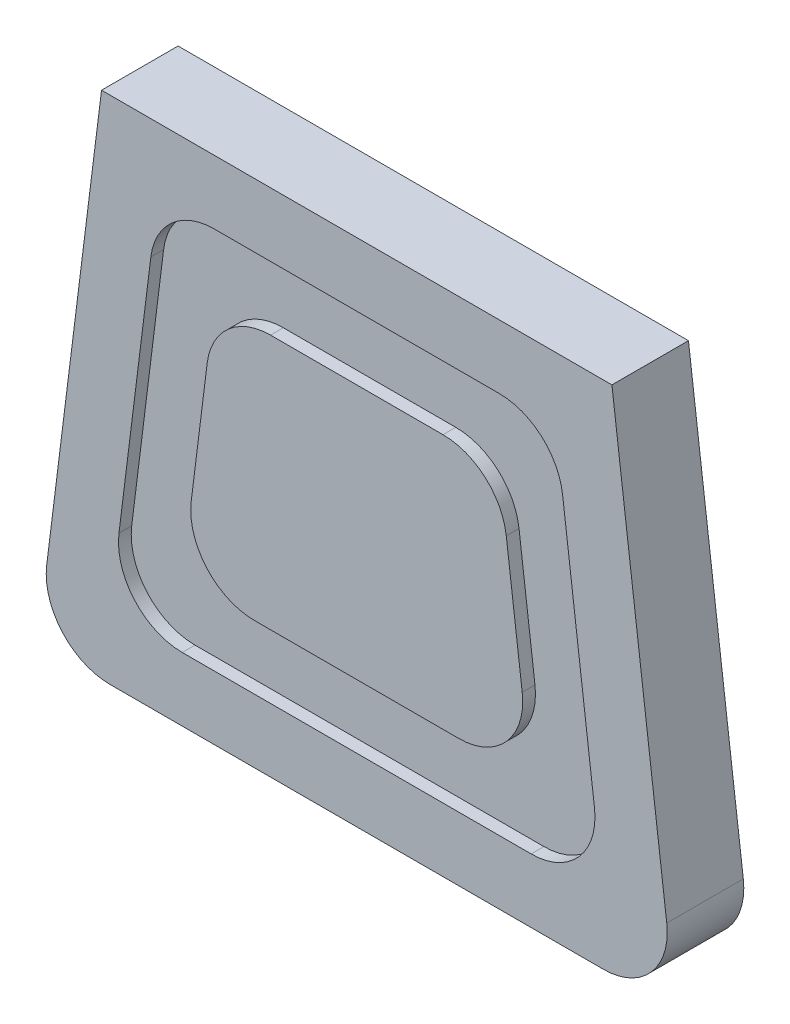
ISO-10303-21;
HEADER;
FILE_DESCRIPTION(('STEP AP214'),'2;1');
FILE_NAME('part.step','',(''),(''),'','','');
FILE_SCHEMA(('AUTOMOTIVE_DESIGN { 1 0 10303 214 1 1 1 1 }'));
ENDSEC;
DATA;
#1=APPLICATION_CONTEXT('core data for automotive mechanical design processes');
#2=APPLICATION_PROTOCOL_DEFINITION('international standard','automotive_design',2000,#1);
#3=PRODUCT_CONTEXT('',#1,'mechanical');
#4=PRODUCT('Part','Part','',(#3));
#5=PRODUCT_RELATED_PRODUCT_CATEGORY('part','',(#4));
#6=PRODUCT_DEFINITION_FORMATION('','',#4);
#7=PRODUCT_DEFINITION_CONTEXT('part definition',#1,'design');
#8=PRODUCT_DEFINITION('design','',#6,#7);
#9=PRODUCT_DEFINITION_SHAPE('','',#8);
#10=(LENGTH_UNIT() NAMED_UNIT(*) SI_UNIT(.MILLI.,.METRE.));
#11=(NAMED_UNIT(*) PLANE_ANGLE_UNIT() SI_UNIT($,.RADIAN.));
#12=(NAMED_UNIT(*) SI_UNIT($,.STERADIAN.) SOLID_ANGLE_UNIT());
#13=UNCERTAINTY_MEASURE_WITH_UNIT(LENGTH_MEASURE(1.E-05),#10,'distance_accuracy_value','');
#14=(GEOMETRIC_REPRESENTATION_CONTEXT(3) GLOBAL_UNCERTAINTY_ASSIGNED_CONTEXT((#13)) GLOBAL_UNIT_ASSIGNED_CONTEXT((#10,
#11,#12)) REPRESENTATION_CONTEXT('',''));
#15=CARTESIAN_POINT('',(0.,0.,0.));
#16=DIRECTION('',(0.,0.,1.));
#17=DIRECTION('',(1.,0.,0.));
#18=AXIS2_PLACEMENT_3D('',#15,#16,#17);
#19=CARTESIAN_POINT('',(-20.,0.,6.));
#20=DIRECTION('',(0.992277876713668,-0.124034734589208,0.));
#21=DIRECTION('',(0.124034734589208,0.992277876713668,0.));
#22=AXIS2_PLACEMENT_3D('',#19,#20,#21);
#23=PLANE('',#22);
#24=DIRECTION('',(-0.124034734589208,-0.992277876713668,0.));
#25=VECTOR('',#24,1.);
#26=CARTESIAN_POINT('',(-20.,0.,0.));
#27=LINE('',#26,#25);
#28=CARTESIAN_POINT('',(-20.,0.,0.));
#29=VERTEX_POINT('',#28);
#30=CARTESIAN_POINT('',(-24.2974782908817,-34.379826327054,0.));
#31=VERTEX_POINT('',#30);
#32=EDGE_CURVE('E198',#29,#31,#27,.T.);
#33=ORIENTED_EDGE('',*,*,#32,.T.);
#34=DIRECTION('',(0.,0.,-1.));
#35=VECTOR('',#34,1.);
#36=CARTESIAN_POINT('',(-24.2974782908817,-34.379826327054,6.));
#37=LINE('',#36,#35);
#38=CARTESIAN_POINT('',(-24.2974782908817,-34.379826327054,6.));
#39=VERTEX_POINT('',#38);
#40=EDGE_CURVE('E226',#31,#39,#37,.F.);
#41=ORIENTED_EDGE('',*,*,#40,.T.);
#42=DIRECTION('',(-0.124034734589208,-0.992277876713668,0.));
#43=VECTOR('',#42,1.);
#44=CARTESIAN_POINT('',(-20.,0.,6.));
#45=LINE('',#44,#43);
#46=CARTESIAN_POINT('',(-20.,0.,6.));
#47=VERTEX_POINT('',#46);
#48=EDGE_CURVE('E199',#47,#39,#45,.T.);
#49=ORIENTED_EDGE('',*,*,#48,.F.);
#50=DIRECTION('',(0.,0.,-1.));
#51=VECTOR('',#50,1.);
#52=CARTESIAN_POINT('',(-20.,0.,6.));
#53=LINE('',#52,#51);
#54=EDGE_CURVE('E193',#47,#29,#53,.T.);
#55=ORIENTED_EDGE('',*,*,#54,.T.);
#56=EDGE_LOOP('',(#33,#41,#49,#55));
#57=FACE_BOUND('',#56,.T.);
#58=ADVANCED_FACE('F26',(#57),#23,.F.);
#59=CARTESIAN_POINT('',(-25.,-40.,6.));
#60=DIRECTION('',(0.,1.,0.));
#61=DIRECTION('',(0.,0.,1.));
#62=AXIS2_PLACEMENT_3D('',#59,#60,#61);
#63=PLANE('',#62);
#64=DIRECTION('',(1.,0.,0.));
#65=VECTOR('',#64,1.);
#66=CARTESIAN_POINT('',(-25.,-40.,0.));
#67=LINE('',#66,#65);
#68=CARTESIAN_POINT('',(-19.3360889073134,-40.,0.));
#69=VERTEX_POINT('',#68);
#70=CARTESIAN_POINT('',(19.3360889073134,-40.,0.));
#71=VERTEX_POINT('',#70);
#72=EDGE_CURVE('E186',#69,#71,#67,.T.);
#73=ORIENTED_EDGE('',*,*,#72,.T.);
#74=DIRECTION('',(0.,0.,-1.));
#75=VECTOR('',#74,1.);
#76=CARTESIAN_POINT('',(19.3360889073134,-40.,6.));
#77=LINE('',#76,#75);
#78=CARTESIAN_POINT('',(19.3360889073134,-40.,6.));
#79=VERTEX_POINT('',#78);
#80=EDGE_CURVE('E220',#71,#79,#77,.F.);
#81=ORIENTED_EDGE('',*,*,#80,.T.);
#82=DIRECTION('',(1.,0.,0.));
#83=VECTOR('',#82,1.);
#84=CARTESIAN_POINT('',(-25.,-40.,6.));
#85=LINE('',#84,#83);
#86=CARTESIAN_POINT('',(-19.3360889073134,-40.,6.));
#87=VERTEX_POINT('',#86);
#88=EDGE_CURVE('E202',#87,#79,#85,.T.);
#89=ORIENTED_EDGE('',*,*,#88,.F.);
#90=DIRECTION('',(0.,0.,-1.));
#91=VECTOR('',#90,1.);
#92=CARTESIAN_POINT('',(-19.3360889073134,-40.,6.));
#93=LINE('',#92,#91);
#94=EDGE_CURVE('E217',#87,#69,#93,.T.);
#95=ORIENTED_EDGE('',*,*,#94,.T.);
#96=EDGE_LOOP('',(#73,#81,#89,#95));
#97=FACE_BOUND('',#96,.T.);
#98=ADVANCED_FACE('F366',(#97),#63,.F.);
#99=CARTESIAN_POINT('',(20.,0.,6.));
#100=DIRECTION('',(-0.992277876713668,-0.124034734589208,0.));
#101=DIRECTION('',(0.124034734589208,-0.992277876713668,0.));
#102=AXIS2_PLACEMENT_3D('',#99,#100,#101);
#103=PLANE('',#102);
#104=DIRECTION('',(-0.124034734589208,0.992277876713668,0.));
#105=VECTOR('',#104,1.);
#106=CARTESIAN_POINT('',(20.,0.,6.));
#107=LINE('',#106,#105);
#108=CARTESIAN_POINT('',(24.2974782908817,-34.379826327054,6.));
#109=VERTEX_POINT('',#108);
#110=CARTESIAN_POINT('',(20.,0.,6.));
#111=VERTEX_POINT('',#110);
#112=EDGE_CURVE('E208',#109,#111,#107,.T.);
#113=ORIENTED_EDGE('',*,*,#112,.F.);
#114=DIRECTION('',(0.,0.,-1.));
#115=VECTOR('',#114,1.);
#116=CARTESIAN_POINT('',(24.2974782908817,-34.379826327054,6.));
#117=LINE('',#116,#115);
#118=CARTESIAN_POINT('',(24.2974782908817,-34.379826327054,0.));
#119=VERTEX_POINT('',#118);
#120=EDGE_CURVE('E182',#109,#119,#117,.T.);
#121=ORIENTED_EDGE('',*,*,#120,.T.);
#122=DIRECTION('',(-0.124034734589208,0.992277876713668,0.));
#123=VECTOR('',#122,1.);
#124=CARTESIAN_POINT('',(20.,0.,0.));
#125=LINE('',#124,#123);
#126=CARTESIAN_POINT('',(20.,0.,0.));
#127=VERTEX_POINT('',#126);
#128=EDGE_CURVE('E175',#119,#127,#125,.T.);
#129=ORIENTED_EDGE('',*,*,#128,.T.);
#130=DIRECTION('',(0.,0.,-1.));
#131=VECTOR('',#130,1.);
#132=CARTESIAN_POINT('',(20.,0.,6.));
#133=LINE('',#132,#131);
#134=EDGE_CURVE('E179',#111,#127,#133,.T.);
#135=ORIENTED_EDGE('',*,*,#134,.F.);
#136=EDGE_LOOP('',(#113,#121,#129,#135));
#137=FACE_BOUND('',#136,.T.);
#138=ADVANCED_FACE('F178',(#137),#103,.F.);
#139=CARTESIAN_POINT('',(20.,0.,6.));
#140=DIRECTION('',(0.,-1.,0.));
#141=DIRECTION('',(0.,0.,-1.));
#142=AXIS2_PLACEMENT_3D('',#139,#140,#141);
#143=PLANE('',#142);
#144=DIRECTION('',(-1.,0.,0.));
#145=VECTOR('',#144,1.);
#146=CARTESIAN_POINT('',(20.,0.,0.));
#147=LINE('',#146,#145);
#148=EDGE_CURVE('E185',#127,#29,#147,.T.);
#149=ORIENTED_EDGE('',*,*,#148,.T.);
#150=ORIENTED_EDGE('',*,*,#54,.F.);
#151=DIRECTION('',(-1.,0.,0.));
#152=VECTOR('',#151,1.);
#153=CARTESIAN_POINT('',(20.,0.,6.));
#154=LINE('',#153,#152);
#155=EDGE_CURVE('E192',#111,#47,#154,.T.);
#156=ORIENTED_EDGE('',*,*,#155,.F.);
#157=ORIENTED_EDGE('',*,*,#134,.T.);
#158=EDGE_LOOP('',(#149,#150,#156,#157));
#159=FACE_BOUND('',#158,.T.);
#160=ADVANCED_FACE('F189',(#159),#143,.F.);
#161=CARTESIAN_POINT('',(-25.,-40.,6.));
#162=DIRECTION('',(0.,0.,1.));
#163=DIRECTION('',(1.,0.,0.));
#164=AXIS2_PLACEMENT_3D('',#161,#162,#163);
#165=PLANE('',#164);
#166=DIRECTION('',(-0.124034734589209,-0.992277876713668,0.));
#167=VECTOR('',#166,1.);
#168=CARTESIAN_POINT('',(-15.5860889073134,-5.,6.));
#169=LINE('',#168,#167);
#170=CARTESIAN_POINT('',(-16.1335671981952,-9.37982632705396,6.));
#171=VERTEX_POINT('',#170);
#172=CARTESIAN_POINT('',(-18.6335671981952,-29.379826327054,6.));
#173=VERTEX_POINT('',#172);
#174=EDGE_CURVE('E339',#171,#173,#169,.T.);
#175=ORIENTED_EDGE('',*,*,#174,.F.);
#176=CARTESIAN_POINT('',(-11.1721778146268,-10.,6.));
#177=DIRECTION('',(0.,0.,1.));
#178=DIRECTION('',(1.,0.,0.));
#179=AXIS2_PLACEMENT_3D('',#176,#177,#178);
#180=CIRCLE('',#179,5.);
#181=CARTESIAN_POINT('',(-11.1721778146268,-5.,6.));
#182=VERTEX_POINT('',#181);
#183=EDGE_CURVE('E283',#171,#182,#180,.F.);
#184=ORIENTED_EDGE('',*,*,#183,.T.);
#185=DIRECTION('',(-1.,0.,0.));
#186=VECTOR('',#185,1.);
#187=CARTESIAN_POINT('',(15.5860889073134,-4.99999999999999,6.));
#188=LINE('',#187,#186);
#189=CARTESIAN_POINT('',(11.1721778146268,-5.,6.));
#190=VERTEX_POINT('',#189);
#191=EDGE_CURVE('E347',#190,#182,#188,.T.);
#192=ORIENTED_EDGE('',*,*,#191,.F.);
#193=CARTESIAN_POINT('',(11.1721778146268,-10.,6.));
#194=DIRECTION('',(0.,0.,1.));
#195=DIRECTION('',(1.,0.,0.));
#196=AXIS2_PLACEMENT_3D('',#193,#194,#195);
#197=CIRCLE('',#196,5.);
#198=CARTESIAN_POINT('',(16.1335671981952,-9.37982632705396,6.));
#199=VERTEX_POINT('',#198);
#200=EDGE_CURVE('E285',#190,#199,#197,.F.);
#201=ORIENTED_EDGE('',*,*,#200,.T.);
#202=DIRECTION('',(-0.124034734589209,0.992277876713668,0.));
#203=VECTOR('',#202,1.);
#204=CARTESIAN_POINT('',(15.5860889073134,-4.99999999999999,6.));
#205=LINE('',#204,#203);
#206=CARTESIAN_POINT('',(18.6335671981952,-29.3798263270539,6.));
#207=VERTEX_POINT('',#206);
#208=EDGE_CURVE('E344',#207,#199,#205,.T.);
#209=ORIENTED_EDGE('',*,*,#208,.F.);
#210=CARTESIAN_POINT('',(13.6721778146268,-30.,6.));
#211=DIRECTION('',(0.,0.,1.));
#212=DIRECTION('',(1.,0.,0.));
#213=AXIS2_PLACEMENT_3D('',#210,#211,#212);
#214=CIRCLE('',#213,5.);
#215=CARTESIAN_POINT('',(13.6721778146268,-35.,6.));
#216=VERTEX_POINT('',#215);
#217=EDGE_CURVE('E40',#207,#216,#214,.F.);
#218=ORIENTED_EDGE('',*,*,#217,.T.);
#219=DIRECTION('',(1.,0.,0.));
#220=VECTOR('',#219,1.);
#221=CARTESIAN_POINT('',(-19.3360889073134,-35.,6.));
#222=LINE('',#221,#220);
#223=CARTESIAN_POINT('',(-13.6721778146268,-35.,6.));
#224=VERTEX_POINT('',#223);
#225=EDGE_CURVE('E342',#224,#216,#222,.T.);
#226=ORIENTED_EDGE('',*,*,#225,.F.);
#227=CARTESIAN_POINT('',(-13.6721778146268,-30.,6.));
#228=DIRECTION('',(0.,0.,1.));
#229=DIRECTION('',(1.,0.,0.));
#230=AXIS2_PLACEMENT_3D('',#227,#228,#229);
#231=CIRCLE('',#230,5.);
#232=EDGE_CURVE('E11',#224,#173,#231,.F.);
#233=ORIENTED_EDGE('',*,*,#232,.T.);
#234=EDGE_LOOP('',(#175,#184,#192,#201,#209,#218,#226,#233));
#235=FACE_BOUND('',#234,.T.);
#236=ORIENTED_EDGE('',*,*,#88,.T.);
#237=CARTESIAN_POINT('',(19.3360889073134,-35.,6.));
#238=DIRECTION('',(0.,0.,1.));
#239=DIRECTION('',(1.,0.,0.));
#240=AXIS2_PLACEMENT_3D('',#237,#238,#239);
#241=CIRCLE('',#240,5.);
#242=EDGE_CURVE('E224',#79,#109,#241,.T.);
#243=ORIENTED_EDGE('',*,*,#242,.T.);
#244=ORIENTED_EDGE('',*,*,#112,.T.);
#245=ORIENTED_EDGE('',*,*,#155,.T.);
#246=ORIENTED_EDGE('',*,*,#48,.T.);
#247=CARTESIAN_POINT('',(-19.3360889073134,-35.,6.));
#248=DIRECTION('',(0.,0.,1.));
#249=DIRECTION('',(1.,0.,0.));
#250=AXIS2_PLACEMENT_3D('',#247,#248,#249);
#251=CIRCLE('',#250,5.);
#252=EDGE_CURVE('E222',#39,#87,#251,.T.);
#253=ORIENTED_EDGE('',*,*,#252,.T.);
#254=EDGE_LOOP('',(#236,#243,#244,#245,#246,#253));
#255=FACE_BOUND('',#254,.T.);
#256=ADVANCED_FACE('F373',(#235,#255),#165,.T.);
#257=CARTESIAN_POINT('',(-25.,-40.,0.));
#258=DIRECTION('',(0.,0.,1.));
#259=DIRECTION('',(1.,0.,0.));
#260=AXIS2_PLACEMENT_3D('',#257,#258,#259);
#261=PLANE('',#260);
#262=ORIENTED_EDGE('',*,*,#128,.F.);
#263=CARTESIAN_POINT('',(19.3360889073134,-35.,0.));
#264=DIRECTION('',(0.,0.,1.));
#265=DIRECTION('',(1.,0.,0.));
#266=AXIS2_PLACEMENT_3D('',#263,#264,#265);
#267=CIRCLE('',#266,5.);
#268=EDGE_CURVE('E215',#119,#71,#267,.F.);
#269=ORIENTED_EDGE('',*,*,#268,.T.);
#270=ORIENTED_EDGE('',*,*,#72,.F.);
#271=CARTESIAN_POINT('',(-19.3360889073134,-35.,0.));
#272=DIRECTION('',(0.,0.,1.));
#273=DIRECTION('',(1.,0.,0.));
#274=AXIS2_PLACEMENT_3D('',#271,#272,#273);
#275=CIRCLE('',#274,5.);
#276=EDGE_CURVE('E213',#69,#31,#275,.F.);
#277=ORIENTED_EDGE('',*,*,#276,.T.);
#278=ORIENTED_EDGE('',*,*,#32,.F.);
#279=ORIENTED_EDGE('',*,*,#148,.F.);
#280=EDGE_LOOP('',(#262,#269,#270,#277,#278,#279));
#281=FACE_BOUND('',#280,.T.);
#282=ADVANCED_FACE('F196',(#281),#261,.F.);
#283=CARTESIAN_POINT('',(19.3360889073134,-35.,6.));
#284=DIRECTION('',(0.,0.,-1.));
#285=DIRECTION('',(-1.,0.,0.));
#286=AXIS2_PLACEMENT_3D('',#283,#284,#285);
#287=CYLINDRICAL_SURFACE('',#286,5.);
#288=ORIENTED_EDGE('',*,*,#242,.F.);
#289=ORIENTED_EDGE('',*,*,#80,.F.);
#290=ORIENTED_EDGE('',*,*,#268,.F.);
#291=ORIENTED_EDGE('',*,*,#120,.F.);
#292=EDGE_LOOP('',(#288,#289,#290,#291));
#293=FACE_BOUND('',#292,.T.);
#294=ADVANCED_FACE('F371',(#293),#287,.T.);
#295=CARTESIAN_POINT('',(-19.3360889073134,-35.,6.));
#296=DIRECTION('',(0.,0.,-1.));
#297=DIRECTION('',(-1.,0.,0.));
#298=AXIS2_PLACEMENT_3D('',#295,#296,#297);
#299=CYLINDRICAL_SURFACE('',#298,5.);
#300=ORIENTED_EDGE('',*,*,#252,.F.);
#301=ORIENTED_EDGE('',*,*,#40,.F.);
#302=ORIENTED_EDGE('',*,*,#276,.F.);
#303=ORIENTED_EDGE('',*,*,#94,.F.);
#304=EDGE_LOOP('',(#300,#301,#302,#303));
#305=FACE_BOUND('',#304,.T.);
#306=ADVANCED_FACE('F376',(#305),#299,.T.);
#307=CARTESIAN_POINT('',(-15.5860889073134,-5.,5.));
#308=DIRECTION('',(-0.992277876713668,0.124034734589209,0.));
#309=DIRECTION('',(-0.124034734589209,-0.992277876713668,0.));
#310=AXIS2_PLACEMENT_3D('',#307,#308,#309);
#311=PLANE('',#310);
#312=DIRECTION('',(-0.124034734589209,-0.992277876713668,0.));
#313=VECTOR('',#312,1.);
#314=CARTESIAN_POINT('',(-15.5860889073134,-5.,5.));
#315=LINE('',#314,#313);
#316=CARTESIAN_POINT('',(-16.1335671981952,-9.37982632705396,5.));
#317=VERTEX_POINT('',#316);
#318=CARTESIAN_POINT('',(-18.6335671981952,-29.379826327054,5.));
#319=VERTEX_POINT('',#318);
#320=EDGE_CURVE('E350',#317,#319,#315,.T.);
#321=ORIENTED_EDGE('',*,*,#320,.F.);
#322=DIRECTION('',(0.,0.,1.));
#323=VECTOR('',#322,1.);
#324=CARTESIAN_POINT('',(-16.1335671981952,-9.37982632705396,6.));
#325=LINE('',#324,#323);
#326=EDGE_CURVE('E230',#317,#171,#325,.T.);
#327=ORIENTED_EDGE('',*,*,#326,.T.);
#328=ORIENTED_EDGE('',*,*,#174,.T.);
#329=DIRECTION('',(0.,0.,1.));
#330=VECTOR('',#329,1.);
#331=CARTESIAN_POINT('',(-18.6335671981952,-29.379826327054,5.));
#332=LINE('',#331,#330);
#333=EDGE_CURVE('E228',#173,#319,#332,.F.);
#334=ORIENTED_EDGE('',*,*,#333,.T.);
#335=EDGE_LOOP('',(#321,#327,#328,#334));
#336=FACE_BOUND('',#335,.T.);
#337=ADVANCED_FACE('F399',(#336),#311,.F.);
#338=CARTESIAN_POINT('',(15.5860889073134,-4.99999999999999,5.));
#339=DIRECTION('',(0.,1.,0.));
#340=DIRECTION('',(-1.,0.,0.));
#341=AXIS2_PLACEMENT_3D('',#338,#339,#340);
#342=PLANE('',#341);
#343=ORIENTED_EDGE('',*,*,#191,.T.);
#344=DIRECTION('',(0.,0.,1.));
#345=VECTOR('',#344,1.);
#346=CARTESIAN_POINT('',(-11.1721778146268,-5.,5.));
#347=LINE('',#346,#345);
#348=CARTESIAN_POINT('',(-11.1721778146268,-5.,5.));
#349=VERTEX_POINT('',#348);
#350=EDGE_CURVE('E236',#182,#349,#347,.F.);
#351=ORIENTED_EDGE('',*,*,#350,.T.);
#352=DIRECTION('',(-1.,0.,0.));
#353=VECTOR('',#352,1.);
#354=CARTESIAN_POINT('',(15.5860889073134,-4.99999999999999,5.));
#355=LINE('',#354,#353);
#356=CARTESIAN_POINT('',(11.1721778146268,-5.,5.));
#357=VERTEX_POINT('',#356);
#358=EDGE_CURVE('E359',#357,#349,#355,.T.);
#359=ORIENTED_EDGE('',*,*,#358,.F.);
#360=DIRECTION('',(0.,0.,1.));
#361=VECTOR('',#360,1.);
#362=CARTESIAN_POINT('',(11.1721778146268,-5.,6.));
#363=LINE('',#362,#361);
#364=EDGE_CURVE('E233',#357,#190,#363,.T.);
#365=ORIENTED_EDGE('',*,*,#364,.T.);
#366=EDGE_LOOP('',(#343,#351,#359,#365));
#367=FACE_BOUND('',#366,.T.);
#368=ADVANCED_FACE('F402',(#367),#342,.F.);
#369=CARTESIAN_POINT('',(15.5860889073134,-4.99999999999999,5.));
#370=DIRECTION('',(0.992277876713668,0.124034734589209,0.));
#371=DIRECTION('',(-0.124034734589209,0.992277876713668,0.));
#372=AXIS2_PLACEMENT_3D('',#369,#370,#371);
#373=PLANE('',#372);
#374=ORIENTED_EDGE('',*,*,#208,.T.);
#375=DIRECTION('',(0.,0.,1.));
#376=VECTOR('',#375,1.);
#377=CARTESIAN_POINT('',(16.1335671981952,-9.37982632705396,5.));
#378=LINE('',#377,#376);
#379=CARTESIAN_POINT('',(16.1335671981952,-9.37982632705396,5.));
#380=VERTEX_POINT('',#379);
#381=EDGE_CURVE('E249',#199,#380,#378,.F.);
#382=ORIENTED_EDGE('',*,*,#381,.T.);
#383=DIRECTION('',(-0.124034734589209,0.992277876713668,0.));
#384=VECTOR('',#383,1.);
#385=CARTESIAN_POINT('',(15.5860889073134,-4.99999999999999,5.));
#386=LINE('',#385,#384);
#387=CARTESIAN_POINT('',(18.6335671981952,-29.3798263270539,5.));
#388=VERTEX_POINT('',#387);
#389=EDGE_CURVE('E356',#388,#380,#386,.T.);
#390=ORIENTED_EDGE('',*,*,#389,.F.);
#391=DIRECTION('',(0.,0.,1.));
#392=VECTOR('',#391,1.);
#393=CARTESIAN_POINT('',(18.6335671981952,-29.3798263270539,6.));
#394=LINE('',#393,#392);
#395=EDGE_CURVE('E246',#388,#207,#394,.T.);
#396=ORIENTED_EDGE('',*,*,#395,.T.);
#397=EDGE_LOOP('',(#374,#382,#390,#396));
#398=FACE_BOUND('',#397,.T.);
#399=ADVANCED_FACE('F407',(#398),#373,.F.);
#400=CARTESIAN_POINT('',(-19.3360889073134,-35.,5.));
#401=DIRECTION('',(0.,-1.,0.));
#402=DIRECTION('',(1.,0.,0.));
#403=AXIS2_PLACEMENT_3D('',#400,#401,#402);
#404=PLANE('',#403);
#405=ORIENTED_EDGE('',*,*,#225,.T.);
#406=DIRECTION('',(0.,0.,1.));
#407=VECTOR('',#406,1.);
#408=CARTESIAN_POINT('',(13.6721778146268,-35.,5.));
#409=LINE('',#408,#407);
#410=CARTESIAN_POINT('',(13.6721778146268,-35.,5.));
#411=VERTEX_POINT('',#410);
#412=EDGE_CURVE('E276',#216,#411,#409,.F.);
#413=ORIENTED_EDGE('',*,*,#412,.T.);
#414=DIRECTION('',(1.,0.,0.));
#415=VECTOR('',#414,1.);
#416=CARTESIAN_POINT('',(-19.3360889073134,-35.,5.));
#417=LINE('',#416,#415);
#418=CARTESIAN_POINT('',(-13.6721778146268,-35.,5.));
#419=VERTEX_POINT('',#418);
#420=EDGE_CURVE('E353',#419,#411,#417,.T.);
#421=ORIENTED_EDGE('',*,*,#420,.F.);
#422=DIRECTION('',(0.,0.,1.));
#423=VECTOR('',#422,1.);
#424=CARTESIAN_POINT('',(-13.6721778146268,-35.,6.));
#425=LINE('',#424,#423);
#426=EDGE_CURVE('E274',#419,#224,#425,.T.);
#427=ORIENTED_EDGE('',*,*,#426,.T.);
#428=EDGE_LOOP('',(#405,#413,#421,#427));
#429=FACE_BOUND('',#428,.T.);
#430=ADVANCED_FACE('F404',(#429),#404,.F.);
#431=CARTESIAN_POINT('',(-15.5860889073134,-5.,5.));
#432=DIRECTION('',(0.,0.,-1.));
#433=DIRECTION('',(-1.,0.,0.));
#434=AXIS2_PLACEMENT_3D('',#431,#432,#433);
#435=PLANE('',#434);
#436=DIRECTION('',(-0.124034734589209,-0.992277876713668,0.));
#437=VECTOR('',#436,1.);
#438=CARTESIAN_POINT('',(-11.1721778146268,-10.,5.));
#439=LINE('',#438,#437);
#440=CARTESIAN_POINT('',(-11.7196561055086,-14.379826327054,5.));
#441=VERTEX_POINT('',#440);
#442=CARTESIAN_POINT('',(-12.9696561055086,-24.3798263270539,5.));
#443=VERTEX_POINT('',#442);
#444=EDGE_CURVE('E300',#441,#443,#439,.T.);
#445=ORIENTED_EDGE('',*,*,#444,.F.);
#446=CARTESIAN_POINT('',(-6.75826672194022,-15.,5.));
#447=DIRECTION('',(0.,0.,-1.));
#448=DIRECTION('',(-1.,0.,0.));
#449=AXIS2_PLACEMENT_3D('',#446,#447,#448);
#450=CIRCLE('',#449,5.);
#451=CARTESIAN_POINT('',(-6.75826672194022,-10.,5.));
#452=VERTEX_POINT('',#451);
#453=EDGE_CURVE('E287',#441,#452,#450,.T.);
#454=ORIENTED_EDGE('',*,*,#453,.T.);
#455=DIRECTION('',(-1.,0.,0.));
#456=VECTOR('',#455,1.);
#457=CARTESIAN_POINT('',(11.1721778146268,-9.99999999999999,5.));
#458=LINE('',#457,#456);
#459=CARTESIAN_POINT('',(6.75826672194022,-9.99999999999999,5.));
#460=VERTEX_POINT('',#459);
#461=EDGE_CURVE('E336',#460,#452,#458,.T.);
#462=ORIENTED_EDGE('',*,*,#461,.F.);
#463=CARTESIAN_POINT('',(6.75826672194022,-15.,5.));
#464=DIRECTION('',(0.,0.,-1.));
#465=DIRECTION('',(-1.,0.,0.));
#466=AXIS2_PLACEMENT_3D('',#463,#464,#465);
#467=CIRCLE('',#466,5.);
#468=CARTESIAN_POINT('',(11.7196561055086,-14.3798263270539,5.));
#469=VERTEX_POINT('',#468);
#470=EDGE_CURVE('E289',#460,#469,#467,.T.);
#471=ORIENTED_EDGE('',*,*,#470,.T.);
#472=DIRECTION('',(-0.124034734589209,0.992277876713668,0.));
#473=VECTOR('',#472,1.);
#474=CARTESIAN_POINT('',(11.1721778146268,-9.99999999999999,5.));
#475=LINE('',#474,#473);
#476=CARTESIAN_POINT('',(12.9696561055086,-24.3798263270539,5.));
#477=VERTEX_POINT('',#476);
#478=EDGE_CURVE('E333',#477,#469,#475,.T.);
#479=ORIENTED_EDGE('',*,*,#478,.F.);
#480=CARTESIAN_POINT('',(8.00826672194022,-25.,5.));
#481=DIRECTION('',(0.,0.,-1.));
#482=DIRECTION('',(-1.,0.,0.));
#483=AXIS2_PLACEMENT_3D('',#480,#481,#482);
#484=CIRCLE('',#483,5.);
#485=CARTESIAN_POINT('',(8.00826672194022,-30.,5.));
#486=VERTEX_POINT('',#485);
#487=EDGE_CURVE('E292',#477,#486,#484,.T.);
#488=ORIENTED_EDGE('',*,*,#487,.T.);
#489=DIRECTION('',(1.,0.,0.));
#490=VECTOR('',#489,1.);
#491=CARTESIAN_POINT('',(-13.6721778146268,-30.,5.));
#492=LINE('',#491,#490);
#493=CARTESIAN_POINT('',(-8.00826672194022,-30.,5.));
#494=VERTEX_POINT('',#493);
#495=EDGE_CURVE('E303',#494,#486,#492,.T.);
#496=ORIENTED_EDGE('',*,*,#495,.F.);
#497=CARTESIAN_POINT('',(-8.00826672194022,-25.,5.));
#498=DIRECTION('',(0.,0.,-1.));
#499=DIRECTION('',(-1.,0.,0.));
#500=AXIS2_PLACEMENT_3D('',#497,#498,#499);
#501=CIRCLE('',#500,5.);
#502=EDGE_CURVE('E33',#494,#443,#501,.T.);
#503=ORIENTED_EDGE('',*,*,#502,.T.);
#504=EDGE_LOOP('',(#445,#454,#462,#471,#479,#488,#496,#503));
#505=FACE_BOUND('',#504,.T.);
#506=ORIENTED_EDGE('',*,*,#358,.T.);
#507=CARTESIAN_POINT('',(-11.1721778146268,-10.,5.));
#508=DIRECTION('',(0.,0.,-1.));
#509=DIRECTION('',(-1.,0.,0.));
#510=AXIS2_PLACEMENT_3D('',#507,#508,#509);
#511=CIRCLE('',#510,5.);
#512=EDGE_CURVE('E244',#349,#317,#511,.F.);
#513=ORIENTED_EDGE('',*,*,#512,.T.);
#514=ORIENTED_EDGE('',*,*,#320,.T.);
#515=CARTESIAN_POINT('',(-13.6721778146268,-30.,5.));
#516=DIRECTION('',(0.,0.,-1.));
#517=DIRECTION('',(-1.,0.,0.));
#518=AXIS2_PLACEMENT_3D('',#515,#516,#517);
#519=CIRCLE('',#518,5.);
#520=EDGE_CURVE('E238',#319,#419,#519,.F.);
#521=ORIENTED_EDGE('',*,*,#520,.T.);
#522=ORIENTED_EDGE('',*,*,#420,.T.);
#523=CARTESIAN_POINT('',(13.6721778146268,-30.,5.));
#524=DIRECTION('',(0.,0.,-1.));
#525=DIRECTION('',(-1.,0.,0.));
#526=AXIS2_PLACEMENT_3D('',#523,#524,#525);
#527=CIRCLE('',#526,5.);
#528=EDGE_CURVE('E240',#411,#388,#527,.F.);
#529=ORIENTED_EDGE('',*,*,#528,.T.);
#530=ORIENTED_EDGE('',*,*,#389,.T.);
#531=CARTESIAN_POINT('',(11.1721778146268,-10.,5.));
#532=DIRECTION('',(0.,0.,-1.));
#533=DIRECTION('',(-1.,0.,0.));
#534=AXIS2_PLACEMENT_3D('',#531,#532,#533);
#535=CIRCLE('',#534,5.);
#536=EDGE_CURVE('E242',#380,#357,#535,.F.);
#537=ORIENTED_EDGE('',*,*,#536,.T.);
#538=EDGE_LOOP('',(#506,#513,#514,#521,#522,#529,#530,#537));
#539=FACE_BOUND('',#538,.T.);
#540=ADVANCED_FACE('F298',(#505,#539),#435,.F.);
#541=CARTESIAN_POINT('',(-11.1721778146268,-10.,5.));
#542=DIRECTION('',(-0.992277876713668,0.124034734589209,0.));
#543=DIRECTION('',(-0.124034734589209,-0.992277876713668,0.));
#544=AXIS2_PLACEMENT_3D('',#541,#542,#543);
#545=PLANE('',#544);
#546=DIRECTION('',(-0.124034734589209,-0.992277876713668,0.));
#547=VECTOR('',#546,1.);
#548=CARTESIAN_POINT('',(-11.1721778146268,-10.,6.));
#549=LINE('',#548,#547);
#550=CARTESIAN_POINT('',(-11.7196561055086,-14.379826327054,6.));
#551=VERTEX_POINT('',#550);
#552=CARTESIAN_POINT('',(-12.9696561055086,-24.3798263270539,6.));
#553=VERTEX_POINT('',#552);
#554=EDGE_CURVE('E321',#551,#553,#549,.T.);
#555=ORIENTED_EDGE('',*,*,#554,.F.);
#556=DIRECTION('',(0.,0.,1.));
#557=VECTOR('',#556,1.);
#558=CARTESIAN_POINT('',(-11.7196561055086,-14.379826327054,5.));
#559=LINE('',#558,#557);
#560=EDGE_CURVE('E267',#551,#441,#559,.F.);
#561=ORIENTED_EDGE('',*,*,#560,.T.);
#562=ORIENTED_EDGE('',*,*,#444,.T.);
#563=DIRECTION('',(0.,0.,1.));
#564=VECTOR('',#563,1.);
#565=CARTESIAN_POINT('',(-12.9696561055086,-24.3798263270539,5.));
#566=LINE('',#565,#564);
#567=EDGE_CURVE('E264',#443,#553,#566,.T.);
#568=ORIENTED_EDGE('',*,*,#567,.T.);
#569=EDGE_LOOP('',(#555,#561,#562,#568));
#570=FACE_BOUND('',#569,.T.);
#571=ADVANCED_FACE('F309',(#570),#545,.T.);
#572=CARTESIAN_POINT('',(11.1721778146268,-9.99999999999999,5.));
#573=DIRECTION('',(0.,1.,0.));
#574=DIRECTION('',(-1.,0.,0.));
#575=AXIS2_PLACEMENT_3D('',#572,#573,#574);
#576=PLANE('',#575);
#577=ORIENTED_EDGE('',*,*,#461,.T.);
#578=DIRECTION('',(0.,0.,1.));
#579=VECTOR('',#578,1.);
#580=CARTESIAN_POINT('',(-6.75826672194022,-10.,5.));
#581=LINE('',#580,#579);
#582=CARTESIAN_POINT('',(-6.75826672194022,-10.,6.));
#583=VERTEX_POINT('',#582);
#584=EDGE_CURVE('E253',#452,#583,#581,.T.);
#585=ORIENTED_EDGE('',*,*,#584,.T.);
#586=DIRECTION('',(-1.,0.,0.));
#587=VECTOR('',#586,1.);
#588=CARTESIAN_POINT('',(11.1721778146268,-9.99999999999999,6.));
#589=LINE('',#588,#587);
#590=CARTESIAN_POINT('',(6.75826672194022,-9.99999999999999,6.));
#591=VERTEX_POINT('',#590);
#592=EDGE_CURVE('E312',#591,#583,#589,.T.);
#593=ORIENTED_EDGE('',*,*,#592,.F.);
#594=DIRECTION('',(0.,0.,1.));
#595=VECTOR('',#594,1.);
#596=CARTESIAN_POINT('',(6.75826672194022,-9.99999999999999,5.));
#597=LINE('',#596,#595);
#598=EDGE_CURVE('E251',#591,#460,#597,.F.);
#599=ORIENTED_EDGE('',*,*,#598,.T.);
#600=EDGE_LOOP('',(#577,#585,#593,#599));
#601=FACE_BOUND('',#600,.T.);
#602=ADVANCED_FACE('F419',(#601),#576,.T.);
#603=CARTESIAN_POINT('',(11.1721778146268,-9.99999999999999,5.));
#604=DIRECTION('',(0.992277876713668,0.124034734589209,0.));
#605=DIRECTION('',(-0.124034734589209,0.992277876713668,0.));
#606=AXIS2_PLACEMENT_3D('',#603,#604,#605);
#607=PLANE('',#606);
#608=ORIENTED_EDGE('',*,*,#478,.T.);
#609=DIRECTION('',(0.,0.,1.));
#610=VECTOR('',#609,1.);
#611=CARTESIAN_POINT('',(11.7196561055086,-14.3798263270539,5.));
#612=LINE('',#611,#610);
#613=CARTESIAN_POINT('',(11.7196561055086,-14.3798263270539,6.));
#614=VERTEX_POINT('',#613);
#615=EDGE_CURVE('E271',#469,#614,#612,.T.);
#616=ORIENTED_EDGE('',*,*,#615,.T.);
#617=DIRECTION('',(-0.124034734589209,0.992277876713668,0.));
#618=VECTOR('',#617,1.);
#619=CARTESIAN_POINT('',(11.1721778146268,-9.99999999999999,6.));
#620=LINE('',#619,#618);
#621=CARTESIAN_POINT('',(12.9696561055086,-24.3798263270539,6.));
#622=VERTEX_POINT('',#621);
#623=EDGE_CURVE('E325',#622,#614,#620,.T.);
#624=ORIENTED_EDGE('',*,*,#623,.F.);
#625=DIRECTION('',(0.,0.,1.));
#626=VECTOR('',#625,1.);
#627=CARTESIAN_POINT('',(12.9696561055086,-24.3798263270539,5.));
#628=LINE('',#627,#626);
#629=EDGE_CURVE('E269',#622,#477,#628,.F.);
#630=ORIENTED_EDGE('',*,*,#629,.T.);
#631=EDGE_LOOP('',(#608,#616,#624,#630));
#632=FACE_BOUND('',#631,.T.);
#633=ADVANCED_FACE('F422',(#632),#607,.T.);
#634=CARTESIAN_POINT('',(-13.6721778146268,-30.,5.));
#635=DIRECTION('',(0.,-1.,0.));
#636=DIRECTION('',(1.,0.,0.));
#637=AXIS2_PLACEMENT_3D('',#634,#635,#636);
#638=PLANE('',#637);
#639=ORIENTED_EDGE('',*,*,#495,.T.);
#640=DIRECTION('',(0.,0.,1.));
#641=VECTOR('',#640,1.);
#642=CARTESIAN_POINT('',(8.00826672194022,-30.,5.));
#643=LINE('',#642,#641);
#644=CARTESIAN_POINT('',(8.00826672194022,-30.,6.));
#645=VERTEX_POINT('',#644);
#646=EDGE_CURVE('E280',#486,#645,#643,.T.);
#647=ORIENTED_EDGE('',*,*,#646,.T.);
#648=DIRECTION('',(1.,0.,0.));
#649=VECTOR('',#648,1.);
#650=CARTESIAN_POINT('',(-13.6721778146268,-30.,6.));
#651=LINE('',#650,#649);
#652=CARTESIAN_POINT('',(-8.00826672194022,-30.,6.));
#653=VERTEX_POINT('',#652);
#654=EDGE_CURVE('E320',#653,#645,#651,.T.);
#655=ORIENTED_EDGE('',*,*,#654,.F.);
#656=DIRECTION('',(0.,0.,1.));
#657=VECTOR('',#656,1.);
#658=CARTESIAN_POINT('',(-8.00826672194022,-30.,5.));
#659=LINE('',#658,#657);
#660=EDGE_CURVE('E278',#653,#494,#659,.F.);
#661=ORIENTED_EDGE('',*,*,#660,.T.);
#662=EDGE_LOOP('',(#639,#647,#655,#661));
#663=FACE_BOUND('',#662,.T.);
#664=ADVANCED_FACE('F323',(#663),#638,.T.);
#665=ORIENTED_EDGE('',*,*,#592,.T.);
#666=CARTESIAN_POINT('',(-6.75826672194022,-15.,6.));
#667=DIRECTION('',(0.,0.,1.));
#668=DIRECTION('',(1.,0.,0.));
#669=AXIS2_PLACEMENT_3D('',#666,#667,#668);
#670=CIRCLE('',#669,5.);
#671=EDGE_CURVE('E262',#583,#551,#670,.T.);
#672=ORIENTED_EDGE('',*,*,#671,.T.);
#673=ORIENTED_EDGE('',*,*,#554,.T.);
#674=CARTESIAN_POINT('',(-8.00826672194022,-25.,6.));
#675=DIRECTION('',(0.,0.,1.));
#676=DIRECTION('',(1.,0.,0.));
#677=AXIS2_PLACEMENT_3D('',#674,#675,#676);
#678=CIRCLE('',#677,5.);
#679=EDGE_CURVE('E256',#553,#653,#678,.T.);
#680=ORIENTED_EDGE('',*,*,#679,.T.);
#681=ORIENTED_EDGE('',*,*,#654,.T.);
#682=CARTESIAN_POINT('',(8.00826672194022,-25.,6.));
#683=DIRECTION('',(0.,0.,1.));
#684=DIRECTION('',(1.,0.,0.));
#685=AXIS2_PLACEMENT_3D('',#682,#683,#684);
#686=CIRCLE('',#685,5.);
#687=EDGE_CURVE('E258',#645,#622,#686,.T.);
#688=ORIENTED_EDGE('',*,*,#687,.T.);
#689=ORIENTED_EDGE('',*,*,#623,.T.);
#690=CARTESIAN_POINT('',(6.75826672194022,-15.,6.));
#691=DIRECTION('',(0.,0.,1.));
#692=DIRECTION('',(1.,0.,0.));
#693=AXIS2_PLACEMENT_3D('',#690,#691,#692);
#694=CIRCLE('',#693,5.);
#695=EDGE_CURVE('E260',#614,#591,#694,.T.);
#696=ORIENTED_EDGE('',*,*,#695,.T.);
#697=EDGE_LOOP('',(#665,#672,#673,#680,#681,#688,#689,#696));
#698=FACE_BOUND('',#697,.T.);
#699=ADVANCED_FACE('F319',(#698),#165,.T.);
#700=CARTESIAN_POINT('',(-11.1721778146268,-10.,5.));
#701=DIRECTION('',(0.,0.,-1.));
#702=DIRECTION('',(-1.,0.,0.));
#703=AXIS2_PLACEMENT_3D('',#700,#701,#702);
#704=CYLINDRICAL_SURFACE('',#703,5.);
#705=ORIENTED_EDGE('',*,*,#512,.F.);
#706=ORIENTED_EDGE('',*,*,#350,.F.);
#707=ORIENTED_EDGE('',*,*,#183,.F.);
#708=ORIENTED_EDGE('',*,*,#326,.F.);
#709=EDGE_LOOP('',(#705,#706,#707,#708));
#710=FACE_BOUND('',#709,.T.);
#711=ADVANCED_FACE('F429',(#710),#704,.F.);
#712=CARTESIAN_POINT('',(11.1721778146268,-10.,5.));
#713=DIRECTION('',(0.,0.,-1.));
#714=DIRECTION('',(-1.,0.,0.));
#715=AXIS2_PLACEMENT_3D('',#712,#713,#714);
#716=CYLINDRICAL_SURFACE('',#715,5.);
#717=ORIENTED_EDGE('',*,*,#536,.F.);
#718=ORIENTED_EDGE('',*,*,#381,.F.);
#719=ORIENTED_EDGE('',*,*,#200,.F.);
#720=ORIENTED_EDGE('',*,*,#364,.F.);
#721=EDGE_LOOP('',(#717,#718,#719,#720));
#722=FACE_BOUND('',#721,.T.);
#723=ADVANCED_FACE('F432',(#722),#716,.F.);
#724=CARTESIAN_POINT('',(-6.75826672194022,-15.,5.));
#725=DIRECTION('',(0.,0.,1.));
#726=DIRECTION('',(1.,0.,0.));
#727=AXIS2_PLACEMENT_3D('',#724,#725,#726);
#728=CYLINDRICAL_SURFACE('',#727,5.);
#729=ORIENTED_EDGE('',*,*,#453,.F.);
#730=ORIENTED_EDGE('',*,*,#560,.F.);
#731=ORIENTED_EDGE('',*,*,#671,.F.);
#732=ORIENTED_EDGE('',*,*,#584,.F.);
#733=EDGE_LOOP('',(#729,#730,#731,#732));
#734=FACE_BOUND('',#733,.T.);
#735=ADVANCED_FACE('F436',(#734),#728,.T.);
#736=CARTESIAN_POINT('',(6.75826672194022,-15.,5.));
#737=DIRECTION('',(0.,0.,1.));
#738=DIRECTION('',(1.,0.,0.));
#739=AXIS2_PLACEMENT_3D('',#736,#737,#738);
#740=CYLINDRICAL_SURFACE('',#739,5.);
#741=ORIENTED_EDGE('',*,*,#470,.F.);
#742=ORIENTED_EDGE('',*,*,#598,.F.);
#743=ORIENTED_EDGE('',*,*,#695,.F.);
#744=ORIENTED_EDGE('',*,*,#615,.F.);
#745=EDGE_LOOP('',(#741,#742,#743,#744));
#746=FACE_BOUND('',#745,.T.);
#747=ADVANCED_FACE('F440',(#746),#740,.T.);
#748=CARTESIAN_POINT('',(13.6721778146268,-30.,5.));
#749=DIRECTION('',(0.,0.,-1.));
#750=DIRECTION('',(-1.,0.,0.));
#751=AXIS2_PLACEMENT_3D('',#748,#749,#750);
#752=CYLINDRICAL_SURFACE('',#751,5.);
#753=ORIENTED_EDGE('',*,*,#528,.F.);
#754=ORIENTED_EDGE('',*,*,#412,.F.);
#755=ORIENTED_EDGE('',*,*,#217,.F.);
#756=ORIENTED_EDGE('',*,*,#395,.F.);
#757=EDGE_LOOP('',(#753,#754,#755,#756));
#758=FACE_BOUND('',#757,.T.);
#759=ADVANCED_FACE('F444',(#758),#752,.F.);
#760=CARTESIAN_POINT('',(8.00826672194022,-25.,5.));
#761=DIRECTION('',(0.,0.,1.));
#762=DIRECTION('',(1.,0.,0.));
#763=AXIS2_PLACEMENT_3D('',#760,#761,#762);
#764=CYLINDRICAL_SURFACE('',#763,5.);
#765=ORIENTED_EDGE('',*,*,#487,.F.);
#766=ORIENTED_EDGE('',*,*,#629,.F.);
#767=ORIENTED_EDGE('',*,*,#687,.F.);
#768=ORIENTED_EDGE('',*,*,#646,.F.);
#769=EDGE_LOOP('',(#765,#766,#767,#768));
#770=FACE_BOUND('',#769,.T.);
#771=ADVANCED_FACE('F448',(#770),#764,.T.);
#772=CARTESIAN_POINT('',(-8.00826672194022,-25.,5.));
#773=DIRECTION('',(0.,0.,1.));
#774=DIRECTION('',(1.,0.,0.));
#775=AXIS2_PLACEMENT_3D('',#772,#773,#774);
#776=CYLINDRICAL_SURFACE('',#775,5.);
#777=ORIENTED_EDGE('',*,*,#502,.F.);
#778=ORIENTED_EDGE('',*,*,#660,.F.);
#779=ORIENTED_EDGE('',*,*,#679,.F.);
#780=ORIENTED_EDGE('',*,*,#567,.F.);
#781=EDGE_LOOP('',(#777,#778,#779,#780));
#782=FACE_BOUND('',#781,.T.);
#783=ADVANCED_FACE('F314',(#782),#776,.T.);
#784=CARTESIAN_POINT('',(-13.6721778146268,-30.,5.));
#785=DIRECTION('',(0.,0.,-1.));
#786=DIRECTION('',(-1.,0.,0.));
#787=AXIS2_PLACEMENT_3D('',#784,#785,#786);
#788=CYLINDRICAL_SURFACE('',#787,5.);
#789=ORIENTED_EDGE('',*,*,#520,.F.);
#790=ORIENTED_EDGE('',*,*,#333,.F.);
#791=ORIENTED_EDGE('',*,*,#232,.F.);
#792=ORIENTED_EDGE('',*,*,#426,.F.);
#793=EDGE_LOOP('',(#789,#790,#791,#792));
#794=FACE_BOUND('',#793,.T.);
#795=ADVANCED_FACE('F455',(#794),#788,.F.);
#796=CLOSED_SHELL('',(#58,#98,#138,#160,#256,#282,#294,#306,#337,#368,#399,#430,#540,#571,#602,
#633,#664,#699,#711,#723,#735,#747,#759,#771,#783,#795));
#797=MANIFOLD_SOLID_BREP('B2',#796);
#798=ADVANCED_BREP_SHAPE_REPRESENTATION('',(#18,#797),#14);
#799=SHAPE_DEFINITION_REPRESENTATION(#9,#798);
ENDSEC;
END-ISO-10303-21;
